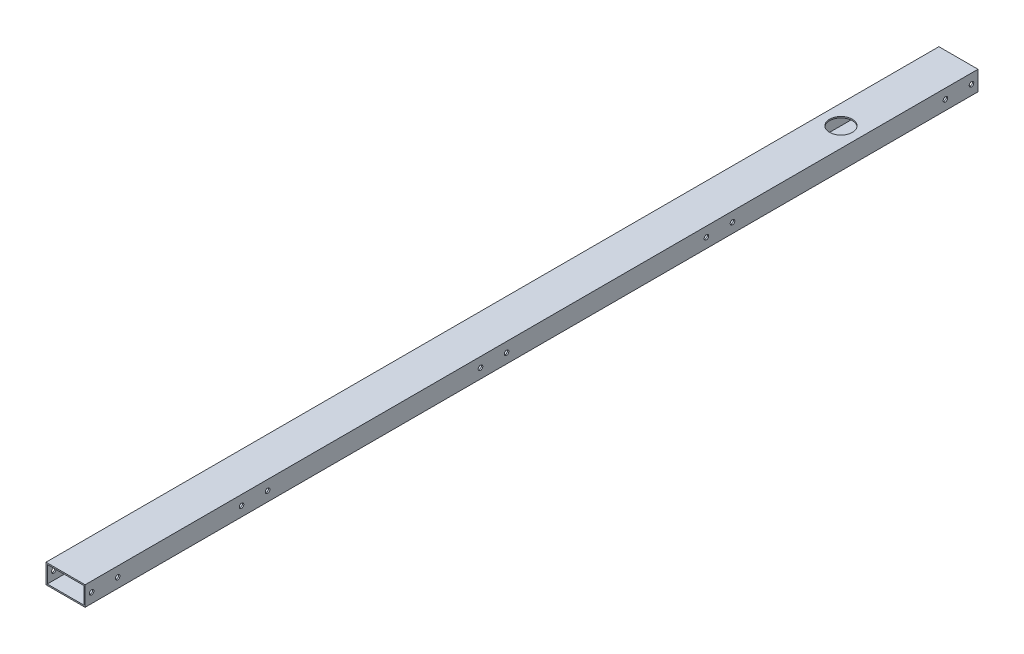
from build123d import *

# Parameters (mm, degrees)
SKETCH1_W               = 60
SKETCH1_H               = 30
SKETCH1_W_2             = 56
SKETCH1_H_2             = 26
BOSS_EXTRUDE1_DEPTH     = 1370
SKETCH2_R               = 3.5
CUT_EXTRUDE3_DEPTH      = 3989.54847268
SKETCH5_R               = 17.5
CUT_EXTRUDE5_DEPTH      = 3935.587246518
CUT_EXTRUDE6_DEPTH      = 4207.659667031
CUT_EXTRUDE6_DEPTH_BACK = 3
SKETCH4_R               = 10
SKETCH4_R_2             = 3.5


with BuildPart() as part:
    # Sketch1 → Boss-Extrude1 (new body)
    with BuildSketch(Plane(origin=(0, 0, 2518.859895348), x_dir=(-1, 0, 0), z_dir=(0, 0, -1))):
        with Locations((-567.365478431, 1587.858156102)):
            Rectangle(SKETCH1_W, SKETCH1_H)
        with Locations((-567.365478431, 1587.858156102)):
            Rectangle(SKETCH1_W_2, SKETCH1_H_2, mode=Mode.SUBTRACT)
    extrude(amount=-BOSS_EXTRUDE1_DEPTH)

    # Sketch2 → Cut-Extrude3 (cut, through all)
    with BuildSketch(Plane(origin=(597.365478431, 718.727151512, 0), x_dir=(0, 1, 0), z_dir=(-1, 0, 0))):
        with Locations(Location((869.13100459, -3838.859895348, 0), (0, 0, 270))):
            Circle(SKETCH2_R)
        with Locations(Location((869.13100459, -3242.193228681, 0), (0, 0, 270))):
            Circle(SKETCH2_R)
        with Locations(Location((869.13100459, -3282.193228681, 0), (0, 0, 270))):
            Circle(SKETCH2_R)
        with Locations(Location((869.13100459, -2895.526562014, 0), (0, 0, 270))):
            Circle(SKETCH2_R)
        with Locations(Location((869.13100459, -2935.526562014, 0), (0, 0, 270))):
            Circle(SKETCH2_R)
        with Locations(Location((869.13100459, -3878.859895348, 0), (0, 0, 270))):
            Circle(SKETCH2_R)
        with Locations(Location((869.13100459, -3648.859895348, 0), (0, 0, 270))):
            Circle(SKETCH2_R)
        with Locations(Location((869.13100459, -3608.859895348, 0), (0, 0, 270))):
            Circle(SKETCH2_R)
        with Locations(Location((869.13100459, -2528.859895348, 0), (0, 0, 270))):
            Circle(SKETCH2_R)
        with Locations(Location((869.13100459, -2568.859895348, 0), (0, 0, 270))):
            Circle(SKETCH2_R)
    extrude(amount=CUT_EXTRUDE3_DEPTH, mode=Mode.SUBTRACT)

    # Sketch5 → Cut-Extrude5 (cut, through all)
    with BuildSketch(Plane.XZ.offset(-1572.858156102)):
        with Locations(Location((567.365478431, 2699.109687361, 0), (0, 0, 270))):
            Circle(SKETCH5_R)
    extrude(amount=-CUT_EXTRUDE5_DEPTH, mode=Mode.SUBTRACT)

    # Sketch4 → Cut-Extrude6 (cut, two sides: drawn at the far end of the back side and taken through both)
    with BuildSketch(Plane.ZY.offset(-537.365478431).offset(-CUT_EXTRUDE6_DEPTH_BACK)):
        with Locations(Location((2895.526562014, 1587.858156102, 0), (0, 0, 180))):
            Circle(SKETCH4_R)
        with Locations(Location((2935.526562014, 1587.858156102, 0), (0, 0, 180))):
            Circle(SKETCH4_R)
        with Locations(Location((3648.859895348, 1587.858156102, 0), (0, 0, 180))):
            Circle(SKETCH4_R)
        with Locations(Location((3242.193228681, 1587.858156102, 0), (0, 0, 180))):
            Circle(SKETCH4_R)
        with Locations(Location((3282.193228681, 1587.858156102, 0), (0, 0, 180))):
            Circle(SKETCH4_R)
        with Locations(Location((2568.859895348, 1587.858156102, 0), (0, 0, 180))):
            Circle(SKETCH4_R)
        with Locations(Location((3838.859895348, 1587.858156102, 0), (0, 0, 180))):
            Circle(SKETCH4_R)
        with Locations((2528.859895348, 1587.858156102)):
            Circle(SKETCH4_R_2)
        with Locations(Location((3608.859895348, 1587.858156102, 0), (0, 0, 180))):
            Circle(SKETCH4_R)
    extrude(amount=CUT_EXTRUDE6_DEPTH + CUT_EXTRUDE6_DEPTH_BACK, mode=Mode.SUBTRACT)


solid = part.part
